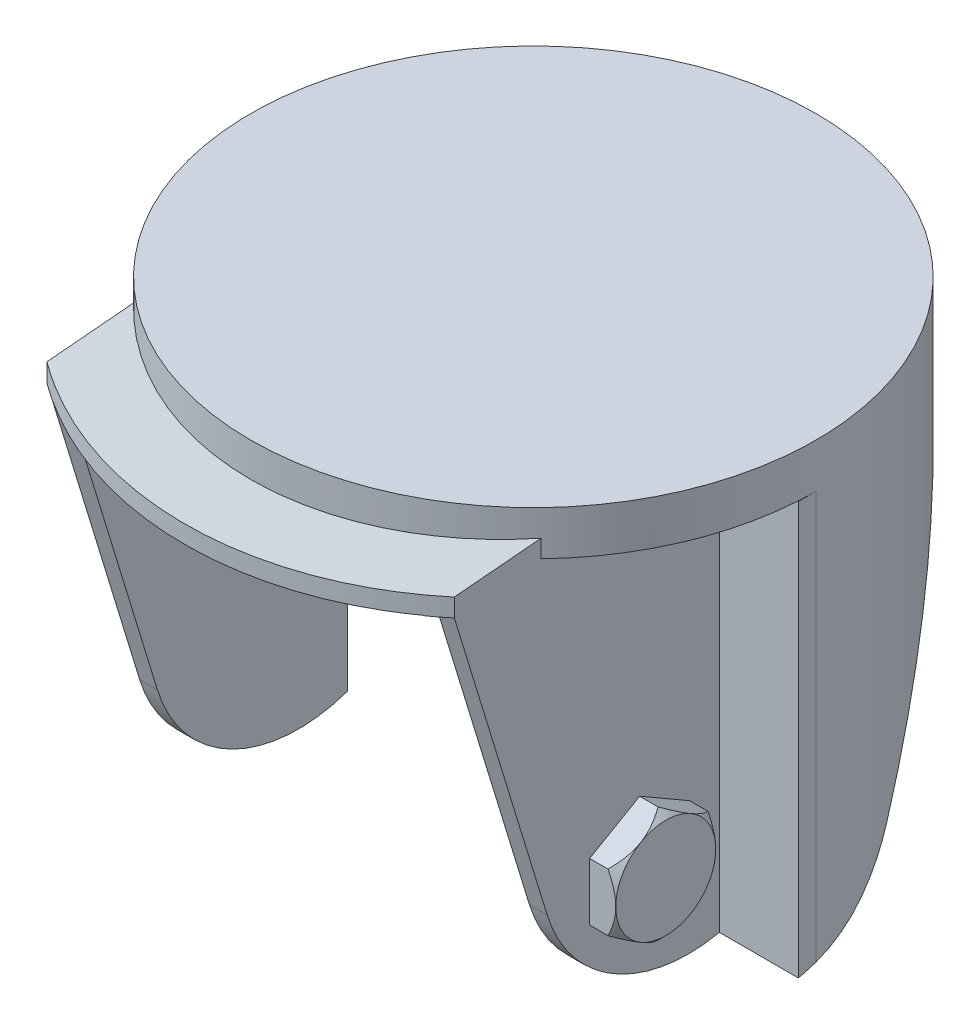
from build123d import *

# Parameters (mm, degrees)
SKETCH_2_W               = 63.84
SKETCH_2_H               = 79
CUT_EXTRUDE_1_DEPTH      = 84
EXTRUDE_1_DEPTH          = 31.92
EXTRUDE_1_DEPTH_BACK     = 31.92
SKETCH_3_W               = 2
SKETCH_3_H               = 54
EXTRUDE_2_DEPTH          = 48.266615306
CUT_EXTRUDE_2_DEPTH      = 50
CUT_EXTRUDE_2_DEPTH_BACK = 50
CUT_EXTRUDE_3_DEPTH      = 35
CUT_EXTRUDE_4_DEPTH      = 79
SKETCH_9_R               = 7.9
CUT_EXTRUDE_5_DEPTH      = 10
SKETCH_11_R              = 7.9
CUT_EXTRUDE_6_DEPTH      = 10


with BuildPart() as part:
    # Sketch 1 → Revolve 1 (revolve)
    with BuildSketch(Plane.XY, mode=Mode.PRIVATE) as revolve_1_sk:
        Polygon((0, -13.7), (31.92, -13.7), (31.92, -79.3), (29.92, -79.3), (29.92, -16.2), (0, -16.2), align=None)
    revolve(revolve_1_sk.sketch.rotate(Axis((0, -79.3, 0), (0, 1, 0)), 270), axis=Axis((0, -79.3, 0), (0, 1, 0)))

    # Sketch 2 → Cut-Extrude 1 (cut)
    with BuildSketch(Plane.XY):
        with Locations((0, -58.2)):
            Rectangle(SKETCH_2_W, SKETCH_2_H)
    extrude(amount=CUT_EXTRUDE_1_DEPTH, mode=Mode.SUBTRACT)

    # Sketch 3 → Extrude 1 (add, two sides: drawn at the far end of the back side and taken through both)
    with BuildSketch(Plane(origin=(0, 0, 0), x_dir=(0, 0, -1), z_dir=(1, 0, 0)).offset(-EXTRUDE_1_DEPTH_BACK)):
        with Locations((-1, -45.7)):
            Rectangle(SKETCH_3_W, SKETCH_3_H)
    extrude(amount=EXTRUDE_1_DEPTH + EXTRUDE_1_DEPTH_BACK)

    # Sketch 4 → Extrude 2 (add)
    with BuildSketch(Plane(origin=(0, 0, 0), x_dir=(1, 0, 0), z_dir=(0, -0.08715574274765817, 0.9961946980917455))):
        Polygon((-23, -14.7), (-23, -69), (-21, -69), (-21, -16.7), (21, -16.7), (21, -69), (23, -69), (23, -14.7), align=None)
    extrude(amount=EXTRUDE_2_DEPTH)

    # Sketch 5 → Cut-Extrude 2 (cut, two sides: drawn at the far end of the back side and taken through both)
    with BuildSketch(Plane(origin=(0, 0, 0), x_dir=(0, 0, -1), z_dir=(1, 0, 0)).offset(-CUT_EXTRUDE_2_DEPTH_BACK)):
        with BuildLine():
            Line((-86.4, -24.359020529), (-86.4, -118.2))
            Line((-86.4, -118.2), (33.6, -118.2))
            Line((33.6, -118.2), (33.6, -18.2))
            Line((33.6, -18.2), (28.6, -18.2))
            Line((28.6, -18.2), (9.396812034, -56.474140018))
            ThreePointArc((9.396812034, -56.474140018), (-6.900796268, -65.607695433), (-21.438273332, -53.873317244))
            Line((-21.438273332, -53.873317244), (-31.92, -19.59263814))
            Line((-31.92, -19.59263814), (-86.4, -24.359020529))
        make_face()
    extrude(amount=CUT_EXTRUDE_2_DEPTH + CUT_EXTRUDE_2_DEPTH_BACK, mode=Mode.SUBTRACT)

    # Sketch 6 → Cut-Extrude 3 (cut)
    with BuildSketch(Plane(origin=(0, 0, 0), x_dir=(1, 0, 0), z_dir=(0, 1, 0))):
        with BuildLine():
            Line((-23, -100), (23, -100))
            Line((23, -100), (23, -31.92))
            ThreePointArc((23, -31.92), (0, -39.343187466), (-23, -31.92))
            Line((-23, -31.92), (-23, -100))
        make_face()
    extrude(amount=-CUT_EXTRUDE_3_DEPTH, mode=Mode.SUBTRACT)

    # Sketch 7 → Cut-Extrude 4 (cut)
    with BuildSketch(Plane(origin=(0, -16.2, 0), x_dir=(-1, 0, 0), z_dir=(0, 1, 0))):
        with BuildLine():
            Line((29.92, 0), (21, 0))
            Line((21, 0), (21, 2))
            Line((21, 2), (-21, 2))
            Line((-21, 2), (-21, 0))
            Line((-21, 0), (-29.92, 0))
            ThreePointArc((-29.92, 0), (0, -29.92), (29.92, 0))
        make_face()
    extrude(amount=-CUT_EXTRUDE_4_DEPTH, mode=Mode.SUBTRACT)

    # Sketch 8 → Revolve 2 (revolve)
    with BuildSketch(Plane.XY.offset(11), mode=Mode.PRIVATE) as revolve_2_sk:
        Polygon((22, -54), (22, -47.416666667), (25.00952381, -47.416666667), (25.95, -48.357142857), (25.95, -54), align=None)
    revolve(revolve_2_sk.sketch.rotate(Axis((25.95, -54, 11), (-1, 0, 0)), 270), axis=Axis((25.95, -54, 11), (-1, 0, 0)))

    # Sketch 9 → Cut-Extrude 5 (cut)
    with BuildSketch(Plane(origin=(23, 0, 0), x_dir=(0, 0, -1), z_dir=(1, 0, 0))):
        with Locations((-11, -54)):
            Circle(SKETCH_9_R)
        Polygon((-16.642857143, -50.74209491), (-16.642857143, -57.25790509), (-11, -60.515810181), (-5.357142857, -57.25790509), (-5.357142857, -50.74209491), (-11, -47.484189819), align=None, mode=Mode.SUBTRACT)
    extrude(amount=CUT_EXTRUDE_5_DEPTH, mode=Mode.SUBTRACT)

    # Sketch 10 → Revolve 3 (revolve)
    with BuildSketch(Plane.XY.offset(11), mode=Mode.PRIVATE) as revolve_3_sk:
        Polygon((-26.95, -54), (-26.95, -48.357142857), (-26.00952381, -47.416666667), (-23, -47.416666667), (-23, -54), align=None)
    revolve(revolve_3_sk.sketch.rotate(Axis((-23, -54, 11), (-1, 0, 0)), 270), axis=Axis((-23, -54, 11), (-1, 0, 0)))

    # Sketch 11 → Cut-Extrude 6 (cut)
    with BuildSketch(Plane(origin=(-23, 0, 0), x_dir=(0, 0, -1), z_dir=(1, 0, 0))):
        with Locations((-11, -54)):
            Circle(SKETCH_11_R)
        Polygon((-16.642857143, -50.74209491), (-16.642857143, -57.25790509), (-11, -60.515810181), (-5.357142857, -57.25790509), (-5.357142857, -50.74209491), (-11, -47.484189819), align=None, mode=Mode.SUBTRACT)
    extrude(amount=-CUT_EXTRUDE_6_DEPTH, mode=Mode.SUBTRACT)


solid = part.part
